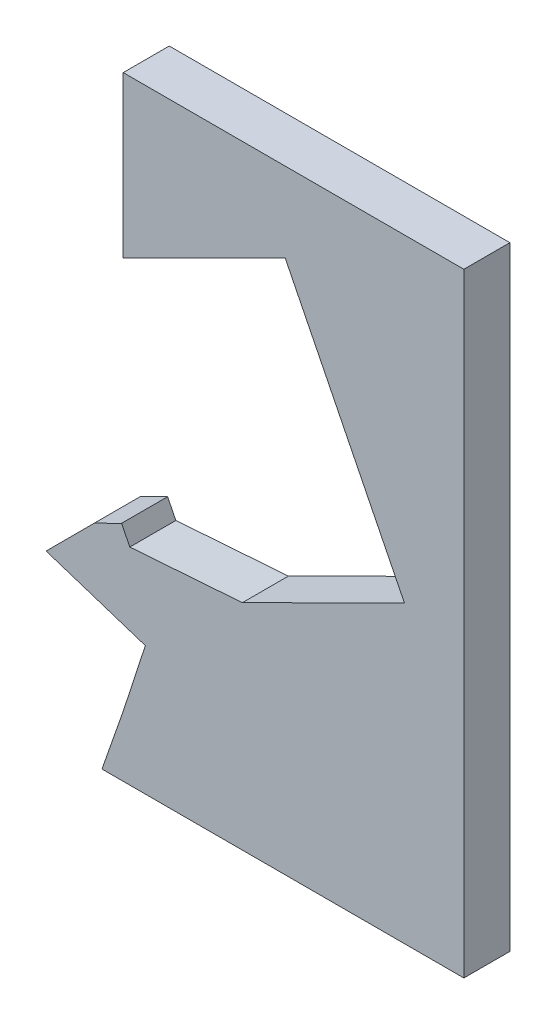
ISO-10303-21;
HEADER;
FILE_DESCRIPTION(('STEP AP214'),'2;1');
FILE_NAME('part.step','',(''),(''),'','','');
FILE_SCHEMA(('AUTOMOTIVE_DESIGN { 1 0 10303 214 1 1 1 1 }'));
ENDSEC;
DATA;
#1=APPLICATION_CONTEXT('core data for automotive mechanical design processes');
#2=APPLICATION_PROTOCOL_DEFINITION('international standard','automotive_design',2000,#1);
#3=PRODUCT_CONTEXT('',#1,'mechanical');
#4=PRODUCT('Part','Part','',(#3));
#5=PRODUCT_RELATED_PRODUCT_CATEGORY('part','',(#4));
#6=PRODUCT_DEFINITION_FORMATION('','',#4);
#7=PRODUCT_DEFINITION_CONTEXT('part definition',#1,'design');
#8=PRODUCT_DEFINITION('design','',#6,#7);
#9=PRODUCT_DEFINITION_SHAPE('','',#8);
#10=(LENGTH_UNIT() NAMED_UNIT(*) SI_UNIT(.MILLI.,.METRE.));
#11=(NAMED_UNIT(*) PLANE_ANGLE_UNIT() SI_UNIT($,.RADIAN.));
#12=(NAMED_UNIT(*) SI_UNIT($,.STERADIAN.) SOLID_ANGLE_UNIT());
#13=UNCERTAINTY_MEASURE_WITH_UNIT(LENGTH_MEASURE(1.E-05),#10,'distance_accuracy_value','');
#14=(GEOMETRIC_REPRESENTATION_CONTEXT(3) GLOBAL_UNCERTAINTY_ASSIGNED_CONTEXT((#13)) GLOBAL_UNIT_ASSIGNED_CONTEXT((#10,
#11,#12)) REPRESENTATION_CONTEXT('',''));
#15=CARTESIAN_POINT('',(0.,0.,0.));
#16=DIRECTION('',(0.,0.,1.));
#17=DIRECTION('',(1.,0.,0.));
#18=AXIS2_PLACEMENT_3D('',#15,#16,#17);
#19=CARTESIAN_POINT('',(-21.6920837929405,17.6410246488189,3.81));
#20=DIRECTION('',(1.,0.,0.));
#21=DIRECTION('',(0.,0.,-1.));
#22=AXIS2_PLACEMENT_3D('',#19,#20,#21);
#23=PLANE('',#22);
#24=DIRECTION('',(0.,-1.,0.));
#25=VECTOR('',#24,1.);
#26=CARTESIAN_POINT('',(-21.6920837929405,17.6410246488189,0.));
#27=LINE('',#26,#25);
#28=CARTESIAN_POINT('',(-21.6920837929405,30.928667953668,0.));
#29=VERTEX_POINT('',#28);
#30=CARTESIAN_POINT('',(-21.6920837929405,17.6410246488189,0.));
#31=VERTEX_POINT('',#30);
#32=EDGE_CURVE('E135',#29,#31,#27,.T.);
#33=ORIENTED_EDGE('',*,*,#32,.T.);
#34=DIRECTION('',(0.,0.,-1.));
#35=VECTOR('',#34,1.);
#36=CARTESIAN_POINT('',(-21.6920837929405,17.6410246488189,3.81));
#37=LINE('',#36,#35);
#38=CARTESIAN_POINT('',(-21.6920837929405,17.6410246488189,3.81));
#39=VERTEX_POINT('',#38);
#40=EDGE_CURVE('E11',#39,#31,#37,.T.);
#41=ORIENTED_EDGE('',*,*,#40,.F.);
#42=DIRECTION('',(0.,-1.,0.));
#43=VECTOR('',#42,1.);
#44=CARTESIAN_POINT('',(-21.6920837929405,17.6410246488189,3.81));
#45=LINE('',#44,#43);
#46=CARTESIAN_POINT('',(-21.6920837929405,30.928667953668,3.81));
#47=VERTEX_POINT('',#46);
#48=EDGE_CURVE('E174',#47,#39,#45,.T.);
#49=ORIENTED_EDGE('',*,*,#48,.F.);
#50=DIRECTION('',(0.,0.,-1.));
#51=VECTOR('',#50,1.);
#52=CARTESIAN_POINT('',(-21.6920837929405,30.928667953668,3.81));
#53=LINE('',#52,#51);
#54=EDGE_CURVE('E148',#47,#29,#53,.T.);
#55=ORIENTED_EDGE('',*,*,#54,.T.);
#56=EDGE_LOOP('',(#33,#41,#49,#55));
#57=FACE_BOUND('',#56,.T.);
#58=ADVANCED_FACE('F31',(#57),#23,.F.);
#59=CARTESIAN_POINT('',(-21.6920837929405,17.6410246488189,3.81));
#60=DIRECTION('',(-0.446197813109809,0.894934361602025,0.));
#61=DIRECTION('',(-0.894934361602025,-0.446197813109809,0.));
#62=AXIS2_PLACEMENT_3D('',#59,#60,#61);
#63=PLANE('',#62);
#64=DIRECTION('',(0.894934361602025,0.446197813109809,0.));
#65=VECTOR('',#64,1.);
#66=CARTESIAN_POINT('',(-21.6920837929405,17.6410246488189,0.));
#67=LINE('',#66,#65);
#68=CARTESIAN_POINT('',(-8.28059744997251,24.3277450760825,0.));
#69=VERTEX_POINT('',#68);
#70=EDGE_CURVE('E131',#31,#69,#67,.T.);
#71=ORIENTED_EDGE('',*,*,#70,.T.);
#72=DIRECTION('',(0.,0.,-1.));
#73=VECTOR('',#72,1.);
#74=CARTESIAN_POINT('',(-8.28059744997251,24.3277450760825,3.81));
#75=LINE('',#74,#73);
#76=CARTESIAN_POINT('',(-8.28059744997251,24.3277450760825,3.81));
#77=VERTEX_POINT('',#76);
#78=EDGE_CURVE('E38',#77,#69,#75,.T.);
#79=ORIENTED_EDGE('',*,*,#78,.F.);
#80=DIRECTION('',(0.894934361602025,0.446197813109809,0.));
#81=VECTOR('',#80,1.);
#82=CARTESIAN_POINT('',(-21.6920837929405,17.6410246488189,3.81));
#83=LINE('',#82,#81);
#84=EDGE_CURVE('E144',#39,#77,#83,.T.);
#85=ORIENTED_EDGE('',*,*,#84,.F.);
#86=ORIENTED_EDGE('',*,*,#40,.T.);
#87=EDGE_LOOP('',(#71,#79,#85,#86));
#88=FACE_BOUND('',#87,.T.);
#89=ADVANCED_FACE('F143',(#88),#63,.F.);
#90=CARTESIAN_POINT('',(-8.28059744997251,24.3277450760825,3.81));
#91=DIRECTION('',(0.894934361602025,0.446197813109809,0.));
#92=DIRECTION('',(-0.446197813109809,0.894934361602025,0.));
#93=AXIS2_PLACEMENT_3D('',#90,#91,#92);
#94=PLANE('',#93);
#95=DIRECTION('',(0.446197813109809,-0.894934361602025,0.));
#96=VECTOR('',#95,1.);
#97=CARTESIAN_POINT('',(-8.28059744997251,24.3277450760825,0.));
#98=LINE('',#97,#96);
#99=CARTESIAN_POINT('',(1.57948182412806,4.55148555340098,0.));
#100=VERTEX_POINT('',#99);
#101=EDGE_CURVE('E137',#69,#100,#98,.T.);
#102=ORIENTED_EDGE('',*,*,#101,.T.);
#103=DIRECTION('',(0.,0.,-1.));
#104=VECTOR('',#103,1.);
#105=CARTESIAN_POINT('',(1.57948182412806,4.55148555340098,3.81));
#106=LINE('',#105,#104);
#107=CARTESIAN_POINT('',(1.57948182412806,4.55148555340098,3.81));
#108=VERTEX_POINT('',#107);
#109=EDGE_CURVE('E230',#108,#100,#106,.T.);
#110=ORIENTED_EDGE('',*,*,#109,.F.);
#111=DIRECTION('',(0.446197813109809,-0.894934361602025,0.));
#112=VECTOR('',#111,1.);
#113=CARTESIAN_POINT('',(-8.28059744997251,24.3277450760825,3.81));
#114=LINE('',#113,#112);
#115=EDGE_CURVE('E177',#77,#108,#114,.T.);
#116=ORIENTED_EDGE('',*,*,#115,.F.);
#117=ORIENTED_EDGE('',*,*,#78,.T.);
#118=EDGE_LOOP('',(#102,#110,#116,#117));
#119=FACE_BOUND('',#118,.T.);
#120=ADVANCED_FACE('F234',(#119),#94,.F.);
#121=CARTESIAN_POINT('',(-11.8320045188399,-2.13523487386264,3.81));
#122=DIRECTION('',(0.446197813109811,-0.894934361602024,0.));
#123=DIRECTION('',(0.894934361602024,0.446197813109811,0.));
#124=AXIS2_PLACEMENT_3D('',#121,#122,#123);
#125=PLANE('',#124);
#126=DIRECTION('',(-0.894934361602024,-0.446197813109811,0.));
#127=VECTOR('',#126,1.);
#128=CARTESIAN_POINT('',(-11.8320045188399,-2.13523487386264,0.));
#129=LINE('',#128,#127);
#130=CARTESIAN_POINT('',(-11.8320045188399,-2.13523487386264,0.));
#131=VERTEX_POINT('',#130);
#132=EDGE_CURVE('E152',#100,#131,#129,.T.);
#133=ORIENTED_EDGE('',*,*,#132,.T.);
#134=DIRECTION('',(0.,0.,-1.));
#135=VECTOR('',#134,1.);
#136=CARTESIAN_POINT('',(-11.8320045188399,-2.13523487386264,3.81));
#137=LINE('',#136,#135);
#138=CARTESIAN_POINT('',(-11.8320045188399,-2.13523487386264,3.81));
#139=VERTEX_POINT('',#138);
#140=EDGE_CURVE('E227',#139,#131,#137,.T.);
#141=ORIENTED_EDGE('',*,*,#140,.F.);
#142=DIRECTION('',(-0.894934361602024,-0.446197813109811,0.));
#143=VECTOR('',#142,1.);
#144=CARTESIAN_POINT('',(-11.8320045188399,-2.13523487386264,3.81));
#145=LINE('',#144,#143);
#146=EDGE_CURVE('E179',#108,#139,#145,.T.);
#147=ORIENTED_EDGE('',*,*,#146,.F.);
#148=ORIENTED_EDGE('',*,*,#109,.T.);
#149=EDGE_LOOP('',(#133,#141,#147,#148));
#150=FACE_BOUND('',#149,.T.);
#151=ADVANCED_FACE('F242',(#150),#125,.F.);
#152=CARTESIAN_POINT('',(-11.8320045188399,-2.13523487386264,3.81));
#153=DIRECTION('',(0.0718432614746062,-0.997415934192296,0.));
#154=DIRECTION('',(0.997415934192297,0.0718432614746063,0.));
#155=AXIS2_PLACEMENT_3D('',#152,#153,#154);
#156=PLANE('',#155);
#157=DIRECTION('',(-0.997415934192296,-0.0718432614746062,0.));
#158=VECTOR('',#157,1.);
#159=CARTESIAN_POINT('',(-11.8320045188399,-2.13523487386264,0.));
#160=LINE('',#159,#158);
#161=CARTESIAN_POINT('',(-21.1473370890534,-2.80621259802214,0.));
#162=VERTEX_POINT('',#161);
#163=EDGE_CURVE('E154',#131,#162,#160,.T.);
#164=ORIENTED_EDGE('',*,*,#163,.T.);
#165=DIRECTION('',(0.,0.,-1.));
#166=VECTOR('',#165,1.);
#167=CARTESIAN_POINT('',(-21.1473370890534,-2.80621259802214,3.81));
#168=LINE('',#167,#166);
#169=CARTESIAN_POINT('',(-21.1473370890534,-2.80621259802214,3.81));
#170=VERTEX_POINT('',#169);
#171=EDGE_CURVE('E224',#170,#162,#168,.T.);
#172=ORIENTED_EDGE('',*,*,#171,.F.);
#173=DIRECTION('',(-0.997415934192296,-0.0718432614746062,0.));
#174=VECTOR('',#173,1.);
#175=CARTESIAN_POINT('',(-11.8320045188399,-2.13523487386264,3.81));
#176=LINE('',#175,#174);
#177=EDGE_CURVE('E181',#139,#170,#176,.T.);
#178=ORIENTED_EDGE('',*,*,#177,.F.);
#179=ORIENTED_EDGE('',*,*,#140,.T.);
#180=EDGE_LOOP('',(#164,#172,#178,#179));
#181=FACE_BOUND('',#180,.T.);
#182=ADVANCED_FACE('F245',(#181),#156,.F.);
#183=CARTESIAN_POINT('',(-21.1473370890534,-2.80621259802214,3.81));
#184=DIRECTION('',(-0.894934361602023,-0.446197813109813,0.));
#185=DIRECTION('',(0.446197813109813,-0.894934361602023,0.));
#186=AXIS2_PLACEMENT_3D('',#183,#184,#185);
#187=PLANE('',#186);
#188=DIRECTION('',(-0.446197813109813,0.894934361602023,0.));
#189=VECTOR('',#188,1.);
#190=CARTESIAN_POINT('',(-21.1473370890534,-2.80621259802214,0.));
#191=LINE('',#190,#189);
#192=CARTESIAN_POINT('',(-21.8273425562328,-1.44233263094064,0.));
#193=VERTEX_POINT('',#192);
#194=EDGE_CURVE('E156',#162,#193,#191,.T.);
#195=ORIENTED_EDGE('',*,*,#194,.T.);
#196=DIRECTION('',(0.,0.,-1.));
#197=VECTOR('',#196,1.);
#198=CARTESIAN_POINT('',(-21.8273425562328,-1.44233263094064,3.81));
#199=LINE('',#198,#197);
#200=CARTESIAN_POINT('',(-21.8273425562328,-1.44233263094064,3.81));
#201=VERTEX_POINT('',#200);
#202=EDGE_CURVE('E221',#201,#193,#199,.T.);
#203=ORIENTED_EDGE('',*,*,#202,.F.);
#204=DIRECTION('',(-0.446197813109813,0.894934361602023,0.));
#205=VECTOR('',#204,1.);
#206=CARTESIAN_POINT('',(-21.1473370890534,-2.80621259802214,3.81));
#207=LINE('',#206,#205);
#208=EDGE_CURVE('E183',#170,#201,#207,.T.);
#209=ORIENTED_EDGE('',*,*,#208,.F.);
#210=ORIENTED_EDGE('',*,*,#171,.T.);
#211=EDGE_LOOP('',(#195,#203,#209,#210));
#212=FACE_BOUND('',#211,.T.);
#213=ADVANCED_FACE('F250',(#212),#187,.F.);
#214=CARTESIAN_POINT('',(-24.100475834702,-2.57567507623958,3.81));
#215=DIRECTION('',(0.446197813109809,-0.894934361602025,0.));
#216=DIRECTION('',(0.894934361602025,0.446197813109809,0.));
#217=AXIS2_PLACEMENT_3D('',#214,#215,#216);
#218=PLANE('',#217);
#219=DIRECTION('',(-0.894934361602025,-0.446197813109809,0.));
#220=VECTOR('',#219,1.);
#221=CARTESIAN_POINT('',(-24.100475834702,-2.57567507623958,0.));
#222=LINE('',#221,#220);
#223=CARTESIAN_POINT('',(-24.100475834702,-2.57567507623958,0.));
#224=VERTEX_POINT('',#223);
#225=EDGE_CURVE('E158',#193,#224,#222,.T.);
#226=ORIENTED_EDGE('',*,*,#225,.T.);
#227=DIRECTION('',(0.,0.,-1.));
#228=VECTOR('',#227,1.);
#229=CARTESIAN_POINT('',(-24.100475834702,-2.57567507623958,3.81));
#230=LINE('',#229,#228);
#231=CARTESIAN_POINT('',(-24.100475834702,-2.57567507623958,3.81));
#232=VERTEX_POINT('',#231);
#233=EDGE_CURVE('E218',#232,#224,#230,.T.);
#234=ORIENTED_EDGE('',*,*,#233,.F.);
#235=DIRECTION('',(-0.894934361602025,-0.446197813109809,0.));
#236=VECTOR('',#235,1.);
#237=CARTESIAN_POINT('',(-24.100475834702,-2.57567507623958,3.81));
#238=LINE('',#237,#236);
#239=EDGE_CURVE('E185',#201,#232,#238,.T.);
#240=ORIENTED_EDGE('',*,*,#239,.F.);
#241=ORIENTED_EDGE('',*,*,#202,.T.);
#242=EDGE_LOOP('',(#226,#234,#240,#241));
#243=FACE_BOUND('',#242,.T.);
#244=ADVANCED_FACE('F256',(#243),#218,.F.);
#245=CARTESIAN_POINT('',(-28.0744583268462,-6.55452383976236,3.81));
#246=DIRECTION('',(0.707539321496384,-0.706673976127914,0.));
#247=DIRECTION('',(0.706673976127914,0.707539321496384,0.));
#248=AXIS2_PLACEMENT_3D('',#245,#246,#247);
#249=PLANE('',#248);
#250=DIRECTION('',(-0.706673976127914,-0.707539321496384,0.));
#251=VECTOR('',#250,1.);
#252=CARTESIAN_POINT('',(-28.0744583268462,-6.55452383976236,0.));
#253=LINE('',#252,#251);
#254=CARTESIAN_POINT('',(-28.0744583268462,-6.55452383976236,0.));
#255=VERTEX_POINT('',#254);
#256=EDGE_CURVE('E160',#224,#255,#253,.T.);
#257=ORIENTED_EDGE('',*,*,#256,.T.);
#258=DIRECTION('',(0.,0.,-1.));
#259=VECTOR('',#258,1.);
#260=CARTESIAN_POINT('',(-28.0744583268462,-6.55452383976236,3.81));
#261=LINE('',#260,#259);
#262=CARTESIAN_POINT('',(-28.0744583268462,-6.55452383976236,3.81));
#263=VERTEX_POINT('',#262);
#264=EDGE_CURVE('E215',#263,#255,#261,.T.);
#265=ORIENTED_EDGE('',*,*,#264,.F.);
#266=DIRECTION('',(-0.706673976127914,-0.707539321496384,0.));
#267=VECTOR('',#266,1.);
#268=CARTESIAN_POINT('',(-28.0744583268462,-6.55452383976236,3.81));
#269=LINE('',#268,#267);
#270=EDGE_CURVE('E187',#232,#263,#269,.T.);
#271=ORIENTED_EDGE('',*,*,#270,.F.);
#272=ORIENTED_EDGE('',*,*,#233,.T.);
#273=EDGE_LOOP('',(#257,#265,#271,#272));
#274=FACE_BOUND('',#273,.T.);
#275=ADVANCED_FACE('F260',(#274),#249,.F.);
#276=CARTESIAN_POINT('',(-28.0744583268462,-6.55452383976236,3.81));
#277=DIRECTION('',(0.309735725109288,0.95082268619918,0.));
#278=DIRECTION('',(-0.95082268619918,0.309735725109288,0.));
#279=AXIS2_PLACEMENT_3D('',#276,#277,#278);
#280=PLANE('',#279);
#281=DIRECTION('',(0.95082268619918,-0.309735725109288,0.));
#282=VECTOR('',#281,1.);
#283=CARTESIAN_POINT('',(-28.0744583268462,-6.55452383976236,0.));
#284=LINE('',#283,#282);
#285=CARTESIAN_POINT('',(-19.8631536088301,-9.22940156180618,0.));
#286=VERTEX_POINT('',#285);
#287=EDGE_CURVE('E162',#255,#286,#284,.T.);
#288=ORIENTED_EDGE('',*,*,#287,.T.);
#289=DIRECTION('',(0.,0.,-1.));
#290=VECTOR('',#289,1.);
#291=CARTESIAN_POINT('',(-19.8631536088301,-9.22940156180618,3.81));
#292=LINE('',#291,#290);
#293=CARTESIAN_POINT('',(-19.8631536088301,-9.22940156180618,3.81));
#294=VERTEX_POINT('',#293);
#295=EDGE_CURVE('E212',#294,#286,#292,.T.);
#296=ORIENTED_EDGE('',*,*,#295,.F.);
#297=DIRECTION('',(0.95082268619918,-0.309735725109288,0.));
#298=VECTOR('',#297,1.);
#299=CARTESIAN_POINT('',(-28.0744583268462,-6.55452383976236,3.81));
#300=LINE('',#299,#298);
#301=EDGE_CURVE('E189',#263,#294,#300,.T.);
#302=ORIENTED_EDGE('',*,*,#301,.F.);
#303=ORIENTED_EDGE('',*,*,#264,.T.);
#304=EDGE_LOOP('',(#288,#296,#302,#303));
#305=FACE_BOUND('',#304,.T.);
#306=ADVANCED_FACE('F265',(#305),#280,.F.);
#307=CARTESIAN_POINT('',(-21.6726297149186,-14.7841076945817,3.81));
#308=DIRECTION('',(0.950822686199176,-0.309735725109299,0.));
#309=DIRECTION('',(0.309735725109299,0.950822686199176,0.));
#310=AXIS2_PLACEMENT_3D('',#307,#308,#309);
#311=PLANE('',#310);
#312=DIRECTION('',(-0.309735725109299,-0.950822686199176,0.));
#313=VECTOR('',#312,1.);
#314=CARTESIAN_POINT('',(-21.6726297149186,-14.7841076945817,0.));
#315=LINE('',#314,#313);
#316=CARTESIAN_POINT('',(-21.6726297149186,-14.7841076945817,0.));
#317=VERTEX_POINT('',#316);
#318=EDGE_CURVE('E164',#286,#317,#315,.T.);
#319=ORIENTED_EDGE('',*,*,#318,.T.);
#320=DIRECTION('',(0.,0.,-1.));
#321=VECTOR('',#320,1.);
#322=CARTESIAN_POINT('',(-21.6726297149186,-14.7841076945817,3.81));
#323=LINE('',#322,#321);
#324=CARTESIAN_POINT('',(-21.6726297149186,-14.7841076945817,3.81));
#325=VERTEX_POINT('',#324);
#326=EDGE_CURVE('E209',#325,#317,#323,.T.);
#327=ORIENTED_EDGE('',*,*,#326,.F.);
#328=DIRECTION('',(-0.309735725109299,-0.950822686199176,0.));
#329=VECTOR('',#328,1.);
#330=CARTESIAN_POINT('',(-21.6726297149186,-14.7841076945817,3.81));
#331=LINE('',#330,#329);
#332=EDGE_CURVE('E191',#294,#325,#331,.T.);
#333=ORIENTED_EDGE('',*,*,#332,.F.);
#334=ORIENTED_EDGE('',*,*,#295,.T.);
#335=EDGE_LOOP('',(#319,#327,#333,#334));
#336=FACE_BOUND('',#335,.T.);
#337=ADVANCED_FACE('F271',(#336),#311,.F.);
#338=CARTESIAN_POINT('',(-21.6726297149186,-14.7841076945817,3.81));
#339=DIRECTION('',(0.943982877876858,-0.329994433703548,0.));
#340=DIRECTION('',(0.329994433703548,0.943982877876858,0.));
#341=AXIS2_PLACEMENT_3D('',#338,#339,#340);
#342=PLANE('',#341);
#343=DIRECTION('',(-0.329994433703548,-0.943982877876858,0.));
#344=VECTOR('',#343,1.);
#345=CARTESIAN_POINT('',(-21.6726297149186,-14.7841076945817,0.));
#346=LINE('',#345,#344);
#347=CARTESIAN_POINT('',(-23.4510048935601,-19.8713320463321,0.));
#348=VERTEX_POINT('',#347);
#349=EDGE_CURVE('E166',#317,#348,#346,.T.);
#350=ORIENTED_EDGE('',*,*,#349,.T.);
#351=DIRECTION('',(0.,0.,-1.));
#352=VECTOR('',#351,1.);
#353=CARTESIAN_POINT('',(-23.4510048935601,-19.8713320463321,3.81));
#354=LINE('',#353,#352);
#355=CARTESIAN_POINT('',(-23.4510048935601,-19.8713320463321,3.81));
#356=VERTEX_POINT('',#355);
#357=EDGE_CURVE('E206',#356,#348,#354,.T.);
#358=ORIENTED_EDGE('',*,*,#357,.F.);
#359=DIRECTION('',(-0.329994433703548,-0.943982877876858,0.));
#360=VECTOR('',#359,1.);
#361=CARTESIAN_POINT('',(-21.6726297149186,-14.7841076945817,3.81));
#362=LINE('',#361,#360);
#363=EDGE_CURVE('E193',#325,#356,#362,.T.);
#364=ORIENTED_EDGE('',*,*,#363,.F.);
#365=ORIENTED_EDGE('',*,*,#326,.T.);
#366=EDGE_LOOP('',(#350,#358,#364,#365));
#367=FACE_BOUND('',#366,.T.);
#368=ADVANCED_FACE('F275',(#367),#342,.F.);
#369=CARTESIAN_POINT('',(-23.4510048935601,-19.8713320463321,3.81));
#370=DIRECTION('',(0.,1.,0.));
#371=DIRECTION('',(0.,0.,1.));
#372=AXIS2_PLACEMENT_3D('',#369,#370,#371);
#373=PLANE('',#372);
#374=DIRECTION('',(1.,0.,0.));
#375=VECTOR('',#374,1.);
#376=CARTESIAN_POINT('',(-23.4510048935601,-19.8713320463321,0.));
#377=LINE('',#376,#375);
#378=CARTESIAN_POINT('',(6.49916875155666,-19.8713320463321,0.));
#379=VERTEX_POINT('',#378);
#380=EDGE_CURVE('E168',#348,#379,#377,.T.);
#381=ORIENTED_EDGE('',*,*,#380,.T.);
#382=DIRECTION('',(0.,0.,-1.));
#383=VECTOR('',#382,1.);
#384=CARTESIAN_POINT('',(6.49916875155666,-19.8713320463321,3.81));
#385=LINE('',#384,#383);
#386=CARTESIAN_POINT('',(6.49916875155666,-19.8713320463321,3.81));
#387=VERTEX_POINT('',#386);
#388=EDGE_CURVE('E203',#387,#379,#385,.T.);
#389=ORIENTED_EDGE('',*,*,#388,.F.);
#390=DIRECTION('',(1.,0.,0.));
#391=VECTOR('',#390,1.);
#392=CARTESIAN_POINT('',(-23.4510048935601,-19.8713320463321,3.81));
#393=LINE('',#392,#391);
#394=EDGE_CURVE('E195',#356,#387,#393,.T.);
#395=ORIENTED_EDGE('',*,*,#394,.F.);
#396=ORIENTED_EDGE('',*,*,#357,.T.);
#397=EDGE_LOOP('',(#381,#389,#395,#396));
#398=FACE_BOUND('',#397,.T.);
#399=ADVANCED_FACE('F280',(#398),#373,.F.);
#400=CARTESIAN_POINT('',(6.49916875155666,30.928667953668,3.81));
#401=DIRECTION('',(-1.,0.,0.));
#402=DIRECTION('',(0.,0.,1.));
#403=AXIS2_PLACEMENT_3D('',#400,#401,#402);
#404=PLANE('',#403);
#405=DIRECTION('',(0.,1.,0.));
#406=VECTOR('',#405,1.);
#407=CARTESIAN_POINT('',(6.49916875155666,30.928667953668,0.));
#408=LINE('',#407,#406);
#409=CARTESIAN_POINT('',(6.49916875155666,30.928667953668,0.));
#410=VERTEX_POINT('',#409);
#411=EDGE_CURVE('E170',#379,#410,#408,.T.);
#412=ORIENTED_EDGE('',*,*,#411,.T.);
#413=DIRECTION('',(0.,0.,-1.));
#414=VECTOR('',#413,1.);
#415=CARTESIAN_POINT('',(6.49916875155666,30.928667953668,3.81));
#416=LINE('',#415,#414);
#417=CARTESIAN_POINT('',(6.49916875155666,30.928667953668,3.81));
#418=VERTEX_POINT('',#417);
#419=EDGE_CURVE('E200',#418,#410,#416,.T.);
#420=ORIENTED_EDGE('',*,*,#419,.F.);
#421=DIRECTION('',(0.,1.,0.));
#422=VECTOR('',#421,1.);
#423=CARTESIAN_POINT('',(6.49916875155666,30.928667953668,3.81));
#424=LINE('',#423,#422);
#425=EDGE_CURVE('E50',#387,#418,#424,.T.);
#426=ORIENTED_EDGE('',*,*,#425,.F.);
#427=ORIENTED_EDGE('',*,*,#388,.T.);
#428=EDGE_LOOP('',(#412,#420,#426,#427));
#429=FACE_BOUND('',#428,.T.);
#430=ADVANCED_FACE('F283',(#429),#404,.F.);
#431=CARTESIAN_POINT('',(-21.6920837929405,30.928667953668,3.81));
#432=DIRECTION('',(0.,-1.,0.));
#433=DIRECTION('',(0.,0.,-1.));
#434=AXIS2_PLACEMENT_3D('',#431,#432,#433);
#435=PLANE('',#434);
#436=DIRECTION('',(-1.,0.,0.));
#437=VECTOR('',#436,1.);
#438=CARTESIAN_POINT('',(-21.6920837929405,30.928667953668,0.));
#439=LINE('',#438,#437);
#440=EDGE_CURVE('E172',#410,#29,#439,.T.);
#441=ORIENTED_EDGE('',*,*,#440,.T.);
#442=ORIENTED_EDGE('',*,*,#54,.F.);
#443=DIRECTION('',(-1.,0.,0.));
#444=VECTOR('',#443,1.);
#445=CARTESIAN_POINT('',(-21.6920837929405,30.928667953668,3.81));
#446=LINE('',#445,#444);
#447=EDGE_CURVE('E45',#418,#47,#446,.T.);
#448=ORIENTED_EDGE('',*,*,#447,.F.);
#449=ORIENTED_EDGE('',*,*,#419,.T.);
#450=EDGE_LOOP('',(#441,#442,#448,#449));
#451=FACE_BOUND('',#450,.T.);
#452=ADVANCED_FACE('F285',(#451),#435,.F.);
#453=CARTESIAN_POINT('',(-21.6920837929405,30.928667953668,3.81));
#454=DIRECTION('',(0.,0.,-1.));
#455=DIRECTION('',(-1.,0.,0.));
#456=AXIS2_PLACEMENT_3D('',#453,#454,#455);
#457=PLANE('',#456);
#458=ORIENTED_EDGE('',*,*,#48,.T.);
#459=ORIENTED_EDGE('',*,*,#84,.T.);
#460=ORIENTED_EDGE('',*,*,#115,.T.);
#461=ORIENTED_EDGE('',*,*,#146,.T.);
#462=ORIENTED_EDGE('',*,*,#177,.T.);
#463=ORIENTED_EDGE('',*,*,#208,.T.);
#464=ORIENTED_EDGE('',*,*,#239,.T.);
#465=ORIENTED_EDGE('',*,*,#270,.T.);
#466=ORIENTED_EDGE('',*,*,#301,.T.);
#467=ORIENTED_EDGE('',*,*,#332,.T.);
#468=ORIENTED_EDGE('',*,*,#363,.T.);
#469=ORIENTED_EDGE('',*,*,#394,.T.);
#470=ORIENTED_EDGE('',*,*,#425,.T.);
#471=ORIENTED_EDGE('',*,*,#447,.T.);
#472=EDGE_LOOP('',(#458,#459,#460,#461,#462,#463,#464,#465,#466,#467,#468,#469,#470,#471));
#473=FACE_BOUND('',#472,.T.);
#474=ADVANCED_FACE('F237',(#473),#457,.F.);
#475=CARTESIAN_POINT('',(-21.6920837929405,30.928667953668,0.));
#476=DIRECTION('',(0.,0.,-1.));
#477=DIRECTION('',(-1.,0.,0.));
#478=AXIS2_PLACEMENT_3D('',#475,#476,#477);
#479=PLANE('',#478);
#480=ORIENTED_EDGE('',*,*,#32,.F.);
#481=ORIENTED_EDGE('',*,*,#440,.F.);
#482=ORIENTED_EDGE('',*,*,#411,.F.);
#483=ORIENTED_EDGE('',*,*,#380,.F.);
#484=ORIENTED_EDGE('',*,*,#349,.F.);
#485=ORIENTED_EDGE('',*,*,#318,.F.);
#486=ORIENTED_EDGE('',*,*,#287,.F.);
#487=ORIENTED_EDGE('',*,*,#256,.F.);
#488=ORIENTED_EDGE('',*,*,#225,.F.);
#489=ORIENTED_EDGE('',*,*,#194,.F.);
#490=ORIENTED_EDGE('',*,*,#163,.F.);
#491=ORIENTED_EDGE('',*,*,#132,.F.);
#492=ORIENTED_EDGE('',*,*,#101,.F.);
#493=ORIENTED_EDGE('',*,*,#70,.F.);
#494=EDGE_LOOP('',(#480,#481,#482,#483,#484,#485,#486,#487,#488,#489,#490,#491,#492,#493));
#495=FACE_BOUND('',#494,.T.);
#496=ADVANCED_FACE('F132',(#495),#479,.T.);
#497=CLOSED_SHELL('',(#58,#89,#120,#151,#182,#213,#244,#275,#306,#337,#368,#399,#430,#452,#474,#496));
#498=MANIFOLD_SOLID_BREP('B2',#497);
#499=ADVANCED_BREP_SHAPE_REPRESENTATION('',(#18,#498),#14);
#500=SHAPE_DEFINITION_REPRESENTATION(#9,#499);
ENDSEC;
END-ISO-10303-21;
